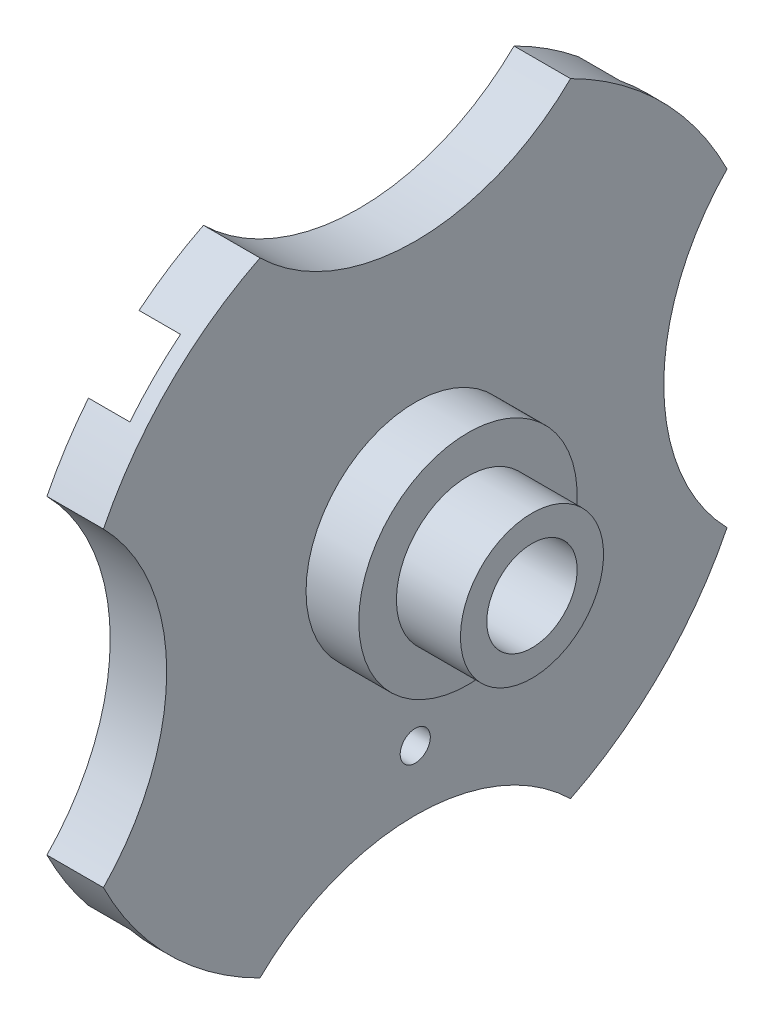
from build123d import *

# Parameters (mm, degrees)
ESQUISSE2_R             = 59
ENL_V_MAT_EXTRU_1_DEPTH = 139.666866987
ENL_V_START             = -11
ENL_V_MAT_EXTRU_2_DEPTH = 11
ESQUISSE4_R             = 4
ENL_V_MAT_EXTRU_3_DEPTH = 126.809424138


with BuildPart() as part:
    # Esquisse1 → Base-R_volution (revolve)
    with BuildSketch(Plane.XY, mode=Mode.PRIVATE) as base_r_volution_sk:
        Polygon((0, 24), (0, 92.5), (15, 92.5), (15, 29), (29, 29), (29, 19), (46, 19), (46, 12), (17, 12), (17, 24), align=None)
    revolve(base_r_volution_sk.sketch.rotate(Axis((0, 0, 0), (1, 0, 0)), 90), axis=Axis((0, 0, 0), (1, 0, 0)))

    # Esquisse2 → Enl_v. mat.-Extru.1 (cut, through all)
    with BuildSketch(Plane.ZY):
        with Locations((0, 125)):
            Circle(ESQUISSE2_R)
        with Locations((125, 0)):
            Circle(ESQUISSE2_R)
        with Locations((0, -125)):
            Circle(ESQUISSE2_R)
        with Locations((-125, 0)):
            Circle(ESQUISSE2_R)
    extrude(amount=-ENL_V_MAT_EXTRU_1_DEPTH, mode=Mode.SUBTRACT)

    # Esquisse3 → Enl_v. mat.-Extru.2 (cut)
    with BuildSketch(Plane.ZY.offset(ENL_V_START)):
        with BuildLine():
            Line((18.738329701, 32.173358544), (58.343994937, 71.77902378))
            ThreePointArc((58.343994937, 71.77902378), (65.40737726, 65.40737726), (71.77902378, 58.343994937))
            Line((71.77902378, 58.343994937), (32.173358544, 18.738329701))
            ThreePointArc((32.173358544, 18.738329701), (18.738329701, 18.738329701), (18.738329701, 32.173358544))
        make_face()
        with BuildLine():
            Line((32.173358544, -18.741271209), (71.77902378, -58.346936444))
            ThreePointArc((71.77902378, -58.346936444), (65.40737726, -65.410318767), (58.343994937, -71.781965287))
            Line((58.343994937, -71.781965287), (18.738329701, -32.176300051))
            ThreePointArc((18.738329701, -32.176300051), (18.738329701, -18.741271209), (32.173358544, -18.741271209))
        make_face()
        with BuildLine():
            Line((-18.741271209, -32.176300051), (-58.346936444, -71.781965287))
            ThreePointArc((-58.346936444, -71.781965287), (-65.410318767, -65.410318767), (-71.781965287, -58.346936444))
            Line((-71.781965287, -58.346936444), (-32.176300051, -18.741271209))
            ThreePointArc((-32.176300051, -18.741271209), (-18.741271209, -18.741271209), (-18.741271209, -32.176300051))
        make_face()
        with BuildLine():
            Line((-32.176300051, 18.738329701), (-71.781965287, 58.343994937))
            ThreePointArc((-71.781965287, 58.343994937), (-65.410318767, 65.40737726), (-58.346936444, 71.77902378))
            Line((-58.346936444, 71.77902378), (-18.741271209, 32.173358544))
            ThreePointArc((-18.741271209, 32.173358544), (-18.741271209, 18.738329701), (-32.176300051, 18.738329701))
        make_face()
    extrude(amount=ENL_V_MAT_EXTRU_2_DEPTH, mode=Mode.SUBTRACT)

    # Esquisse4 → Enl_v. mat.-Extru.3 (cut, through all)
    with BuildSketch(Plane.ZY):
        with Locations((0, -50)):
            Circle(ESQUISSE4_R)
    extrude(amount=-ENL_V_MAT_EXTRU_3_DEPTH, mode=Mode.SUBTRACT)


solid = part.part
